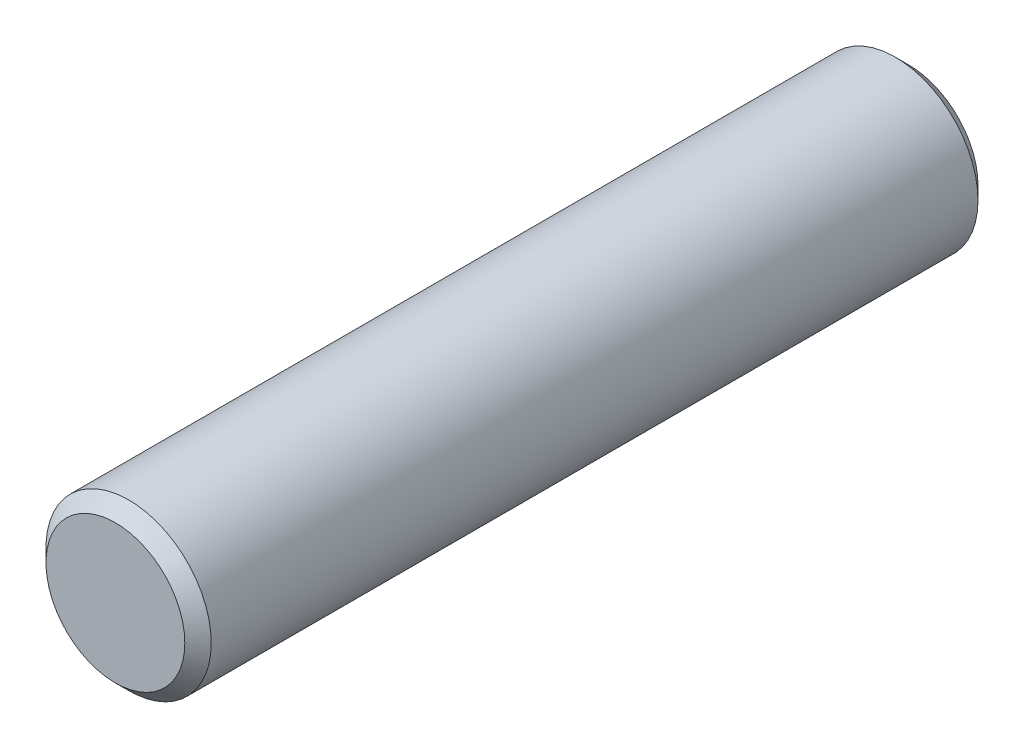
from build123d import *

# Parameters (mm, degrees)
AUFSATZ_LINEAR_AUSTRAGEN1_DEPTH      = 6
AUFSATZ_LINEAR_AUSTRAGEN1_DEPTH_BACK = 6
SKIZZE1_R                            = 1.25
FASE1_SIZE                           = 0.2


with BuildPart() as part:
    # Skizze1 → Aufsatz-Linear austragen1 (new, two sides: drawn at the far end of the back side and taken through both)
    with BuildSketch(Plane.XY.offset(-AUFSATZ_LINEAR_AUSTRAGEN1_DEPTH_BACK)):
        Circle(SKIZZE1_R)
    extrude(amount=AUFSATZ_LINEAR_AUSTRAGEN1_DEPTH + AUFSATZ_LINEAR_AUSTRAGEN1_DEPTH_BACK)

    # Fase1
    fase1_edges = [part.edges().sort_by_distance(p)[0] for p in [
        (-1.25, 0, -6),
        (-1.25, 0, 6),
    ]]
    chamfer(fase1_edges, length=FASE1_SIZE)


solid = part.part
